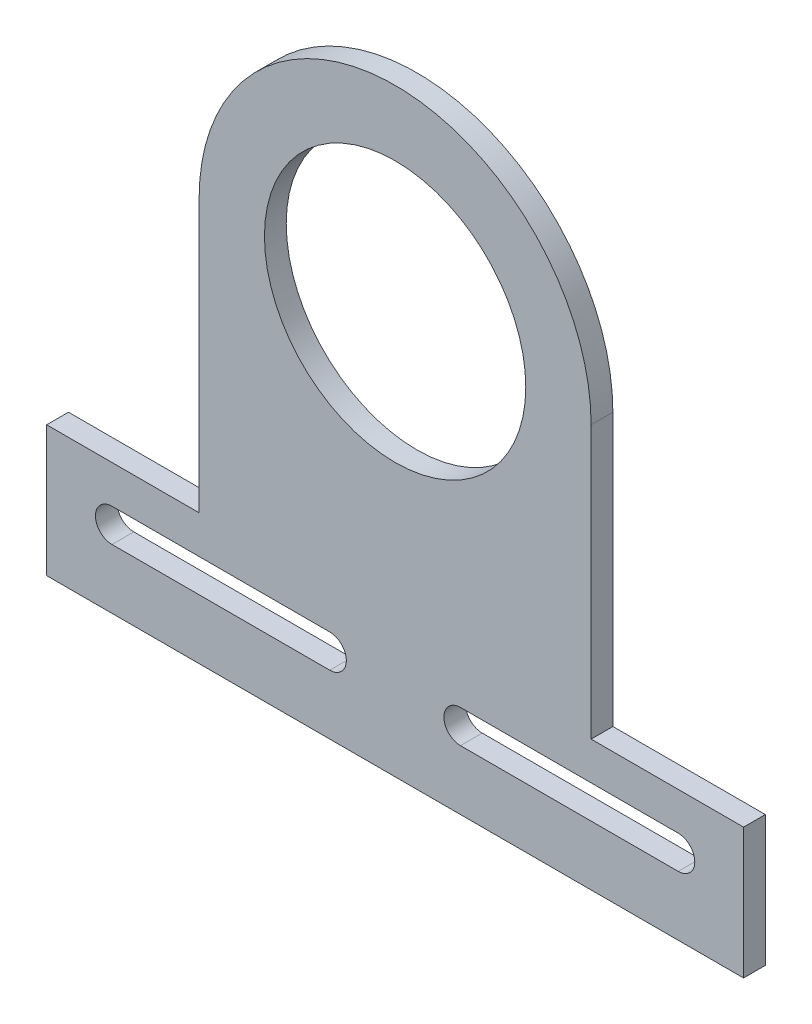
from build123d import *

# Parameters (mm, degrees)
SKETCH1_R          = 14.2875
EXTRUDE1_DEPTH     = 6.35
SKETCH2_R          = 38.1
CUT_EXTRUDE1_DEPTH = 156.445354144
CUT_EXTRUDE3_DEPTH = 156.445354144


with BuildPart() as part:
    # Sketch1 → Extrude1 (new body)
    with BuildSketch(Plane.XY):
        with BuildLine():
            Line((57.15, 0), (57.15, -79.375))
            Line((57.15, -79.375), (101.6, -79.375))
            Line((101.6, -79.375), (101.6, -117.475))
            Line((101.6, -117.475), (-101.6, -117.475))
            Line((-101.6, -117.475), (-101.6, -79.375))
            Line((-101.6, -79.375), (-57.15, -79.375))
            Line((-57.15, -79.375), (-57.15, 0))
            ThreePointArc((-57.15, 0), (0, 57.15), (57.15, 0))
        make_face()
        Circle(SKETCH1_R, mode=Mode.SUBTRACT)
    extrude(amount=EXTRUDE1_DEPTH)

    # Sketch2 → Cut-Extrude1 (cut, through all)
    with BuildSketch(Plane.XY.offset(6.35)):
        Circle(SKETCH2_R)
    extrude(amount=-CUT_EXTRUDE1_DEPTH, mode=Mode.SUBTRACT)

    # Sketch4 → Cut-Extrude3 (cut, through all)
    with BuildSketch(Plane.XY.offset(6.35)):
        with BuildLine():
            Line((-82.55, -100.076), (-19.05, -100.076))
            ThreePointArc((-19.05, -100.076), (-14.224, -95.25), (-19.05, -90.424))
            Line((-19.05, -90.424), (-82.55, -90.424))
            ThreePointArc((-82.55, -90.424), (-87.376, -95.25), (-82.55, -100.076))
        make_face()
    cut_extrude3 = extrude(amount=-CUT_EXTRUDE3_DEPTH, mode=Mode.SUBTRACT)

    # Mirror1: Cut-Extrude3 across plane
    add(cut_extrude3.mirror(Plane(origin=(0, 0, 0), x_dir=(0, 0, 1), z_dir=(1, 0, 0))), mode=Mode.SUBTRACT)


solid = part.part
